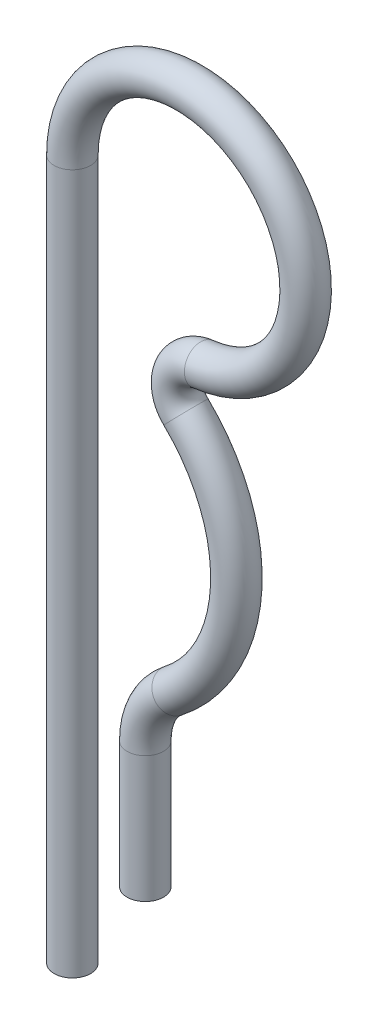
from build123d import *

# Parameters (mm, degrees)
ESQUISSE2_R = 1.25


with BuildPart() as part:
    # Balayage1: sweep along a path in Esquisse1
    with BuildLine(Plane.XY) as balayage1_path:
        Line((-5, -7.038962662), (-5, 40.961037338))
        ThreePointArc((-5, 40.961037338), (8.313657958, 46.94142521), (3.941259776, 33.016603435))
        ThreePointArc((3.941259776, 33.016603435), (2.280354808, 31.666380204), (2.791431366, 29.587796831))
        ThreePointArc((2.791431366, 29.587796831), (6.235322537, 20.898139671), (1.923076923, 12.605066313))
        ThreePointArc((1.923076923, 12.605066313), (0.506414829, 10.856576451), (0, 8.663931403))
        Line((0, 8.663931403), (0, 0))
    # Esquisse2 → Balayage1 (sweep)
    with BuildSketch(Plane(origin=(0, 0, 0), x_dir=(1, 0, 0), z_dir=(0, 1, 0))):
        Circle(ESQUISSE2_R)
    sweep(path=balayage1_path.line)


solid = part.part
